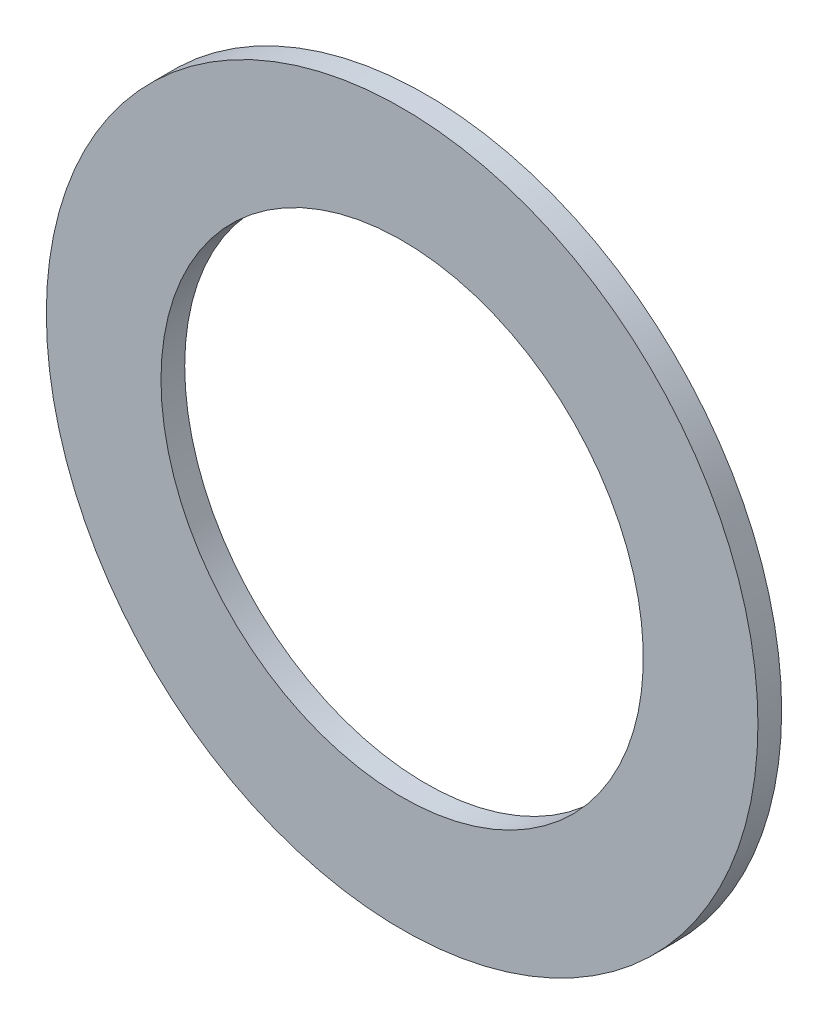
from build123d import *

# Parameters (mm, degrees)
ESQUISSE1_R          = 9
ESQUISSE1_R_2        = 6.1
BASE_EXTRUSION_DEPTH = 0.6


with BuildPart() as part:
    # Esquisse1 → Base-Extrusion (new body)
    with BuildSketch(Plane.XY):
        Circle(ESQUISSE1_R)
        Circle(ESQUISSE1_R_2, mode=Mode.SUBTRACT)
    extrude(amount=BASE_EXTRUSION_DEPTH)


solid = part.part
